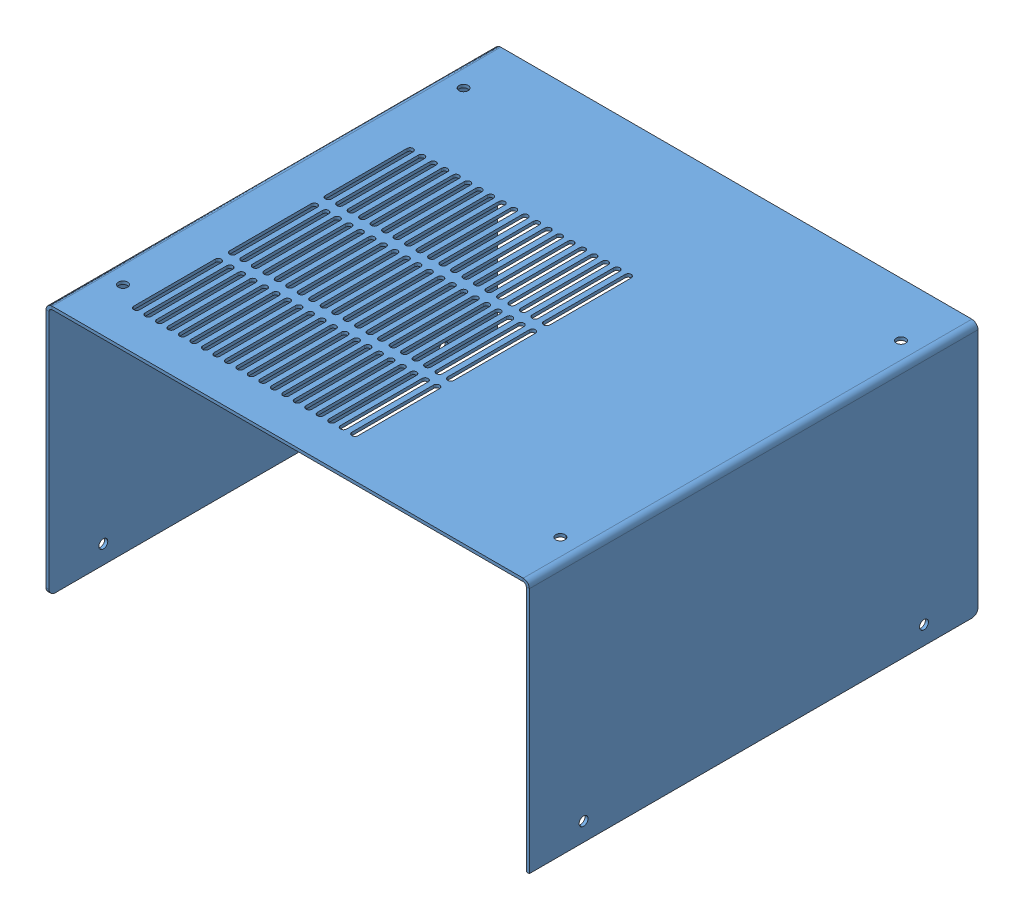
SolidWorks assembly S100110.SLDASM, configuration Výchozí (file format 5000). Lengths in mm.
Overall size (237 124 220).
2 component instances, 2 part files, 4 mates.
Components (placement in the parent):
- 100108-1: 100108.SLDPRT [Výchozí] at origin size (237 124 220)
- Faston 6.3-F1-1: Faston 6.3-F1.SLDPRT [Výchozí] at (167.8926 119.5711 200.016) x (0 0 -1) z (-1 0 0) size (11.8 13.3 8)
Mates (geometry in assembly coordinates):
- Rovnoběžná1: parallel aligned: line of 100108-1 through (-29.1181 120.3711 220) axis (1 0 0); line of Faston 6.3-F1-1 through (163.8926 119.5711 200.016) axis (1 0 0)
- Sjednocená2: coincident anti-aligned: plane of 100108-1 through (-32.1181 120.3711 220) normal (0 -1 0); plane of Faston 6.3-F1-1 through (163.8926 120.3711 200.016) normal (0 1 0)
- Vzdálenost1: distance = 20 mm: line of Faston 6.3-F1-1 through (163.8926 119.5711 200.016) axis (1 0 0); line of 100108-1 through (-29.1181 120.3711 220) axis (1 0 0)
- Vzdálenost2: distance = 30 mm: line of Faston 6.3-F1-1 through (171.8926 119.5711 200.016) axis (0 0 -1); line of 100108-1 through (201.8819 120.3711 220) axis (0 0 -1)
